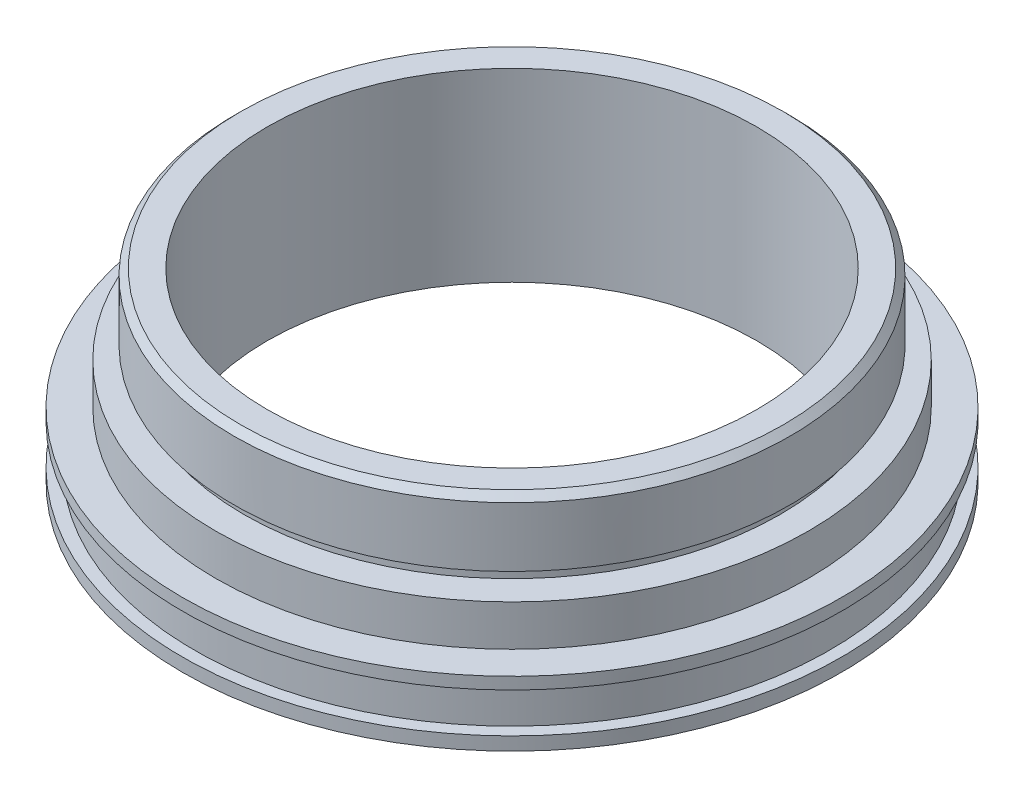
from build123d import *

# Parameters (mm, degrees)
SKETCH1_R           = 24.9
BOSS_EXTRUDE1_DEPTH = 4.9
SKETCH2_R           = 22.4
BOSS_EXTRUDE2_DEPTH = 3.1
SKETCH3_R           = 21
BOSS_EXTRUDE3_DEPTH = 6
SKETCH4_R           = 18.5
CUT_EXTRUDE1_DEPTH  = 38.894854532
SKETCH5_W           = 0.9
SKETCH5_H           = 3
SKETCH6_W           = 0.75
SKETCH6_H           = 1
CHAMFER1_SIZE       = 0.5


with BuildPart() as part:
    # Sketch1 → Boss-Extrude1 (new body)
    with BuildSketch(Plane(origin=(0, 0, 0), x_dir=(1, 0, 0), z_dir=(0, 1, 0))):
        with Locations(Location((0, 0, 0), (0, 0, 270))):
            Circle(SKETCH1_R)
    extrude(amount=BOSS_EXTRUDE1_DEPTH)

    # Sketch2 → Boss-Extrude2 (add)
    with BuildSketch(Plane(origin=(0, 4.9, 0), x_dir=(1, 0, 0), z_dir=(0, 1, 0))):
        with Locations(Location((0, 0, 0), (0, 0, 90))):
            Circle(SKETCH2_R)
    extrude(amount=BOSS_EXTRUDE2_DEPTH)

    # Sketch3 → Boss-Extrude3 (add)
    with BuildSketch(Plane(origin=(0, 8, 0), x_dir=(1, 0, 0), z_dir=(0, 1, 0))):
        with Locations(Location((0, 0, 0), (0, 0, 270))):
            Circle(SKETCH3_R)
    extrude(amount=BOSS_EXTRUDE3_DEPTH)

    # Sketch4 → Cut-Extrude1 (cut, through all)
    with BuildSketch(Plane(origin=(0, 14, 0), x_dir=(1, 0, 0), z_dir=(0, 1, 0))):
        with Locations(Location((0, 0, 0), (0, 0, 270))):
            Circle(SKETCH4_R)
    extrude(amount=-CUT_EXTRUDE1_DEPTH, mode=Mode.SUBTRACT)

    # Sketch5 → Cut-Revolve1 (revolve, cut)
    with BuildSketch(Plane(origin=(0, 0, 0), x_dir=(0, 0, -1), z_dir=(1, 0, 0)), mode=Mode.PRIVATE) as cut_revolve1_sk:
        with Locations((-24.45, 2.5)):
            Rectangle(SKETCH5_W, SKETCH5_H)
    revolve(cut_revolve1_sk.sketch.rotate(Axis((0, 0, 0), (0, 1, 0)), 180), axis=Axis((0, 0, 0), (0, 1, 0)), mode=Mode.SUBTRACT)

    # Sketch6 → Cut-Revolve2 (revolve, cut)
    with BuildSketch(Plane(origin=(0, 0, 0), x_dir=(0, 0, -1), z_dir=(1, 0, 0)), mode=Mode.PRIVATE) as cut_revolve2_sk:
        with Locations((-20.625, 8.5)):
            Rectangle(SKETCH6_W, SKETCH6_H)
    revolve(cut_revolve2_sk.sketch.rotate(Axis((0, 0, 0), (0, 1, 0)), 180), axis=Axis((0, 0, 0), (0, 1, 0)), mode=Mode.SUBTRACT)

    # Chamfer1
    chamfer1_edges = [part.edges().sort_by_distance(p)[0] for p in [
        (0, 14, -21),
    ]]
    chamfer(chamfer1_edges, length=CHAMFER1_SIZE)


solid = part.part
